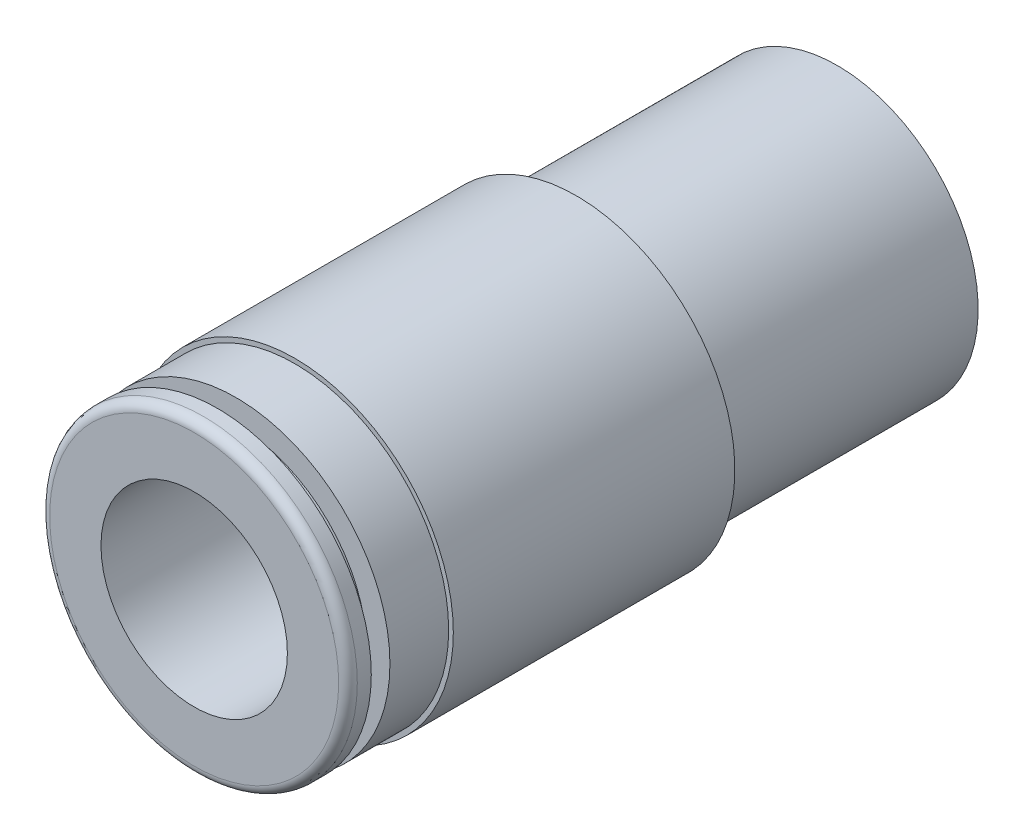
from build123d import *

# Parameters (mm, degrees)
SKETCH1_R             = 8.5
SKETCH1_R_2           = 5
INSERT_DEPTH          = 29.1
SKETCH2_R             = 8.25
SKETCH2_R_2           = 5
CHUCK_SHOULDER_DEPTH  = 3.15
SKETCH4_R             = 7
SKETCH4_R_2           = 5
CHUCK_MINOR_DIA_DEPTH = 1
SKETCH5_R             = 8.25
SKETCH5_R_2           = 5
CHUCK_TOP_DEPTH       = 1.25
CHUCK_TOP_FILLET_R    = 0.5
SKETCH6_R             = 10.8242273
SKETCH6_R_2           = 7.55
CUT_EXTRUDE1_DEPTH    = 14


with BuildPart() as part:
    # Sketch1 → Insert (new body)
    with BuildSketch(Plane.XY):
        Circle(SKETCH1_R)
        Circle(SKETCH1_R_2, mode=Mode.SUBTRACT)
    extrude(amount=INSERT_DEPTH)

    # Sketch2 → chuck shoulder (add)
    with BuildSketch(Plane.XY.offset(29.1)):
        Circle(SKETCH2_R)
        Circle(SKETCH2_R_2, mode=Mode.SUBTRACT)
    extrude(amount=CHUCK_SHOULDER_DEPTH)

    # Sketch4 → chuck minor dia (add)
    with BuildSketch(Plane.XY.offset(32.25)):
        Circle(SKETCH4_R)
        Circle(SKETCH4_R_2, mode=Mode.SUBTRACT)
    extrude(amount=CHUCK_MINOR_DIA_DEPTH)

    # Sketch5 → chuck top (add)
    with BuildSketch(Plane.XY.offset(33.25)):
        Circle(SKETCH5_R)
        Circle(SKETCH5_R_2, mode=Mode.SUBTRACT)
    extrude(amount=CHUCK_TOP_DEPTH)

    # chuck top fillet
    chuck_top_fillet_edges = [part.edges().sort_by_distance(p)[0] for p in [
        (-8.25, 0, 34.5),
    ]]
    fillet(chuck_top_fillet_edges, radius=CHUCK_TOP_FILLET_R)

    # Sketch6 → Cut-Extrude1 (cut)
    with BuildSketch(Plane(origin=(0, 0, 0), x_dir=(-1, 0, 0), z_dir=(0, 0, -1))):
        Circle(SKETCH6_R)
        Circle(SKETCH6_R_2, mode=Mode.SUBTRACT)
    extrude(amount=-CUT_EXTRUDE1_DEPTH, mode=Mode.SUBTRACT)


solid = part.part
